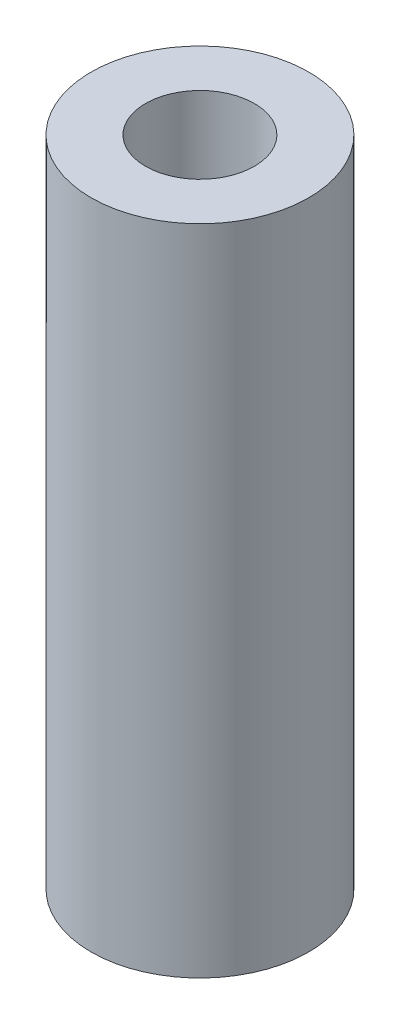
ISO-10303-21;
HEADER;
FILE_DESCRIPTION(('STEP AP214'),'2;1');
FILE_NAME('part.step','',(''),(''),'','','');
FILE_SCHEMA(('AUTOMOTIVE_DESIGN { 1 0 10303 214 1 1 1 1 }'));
ENDSEC;
DATA;
#1=APPLICATION_CONTEXT('core data for automotive mechanical design processes');
#2=APPLICATION_PROTOCOL_DEFINITION('international standard','automotive_design',2000,#1);
#3=PRODUCT_CONTEXT('',#1,'mechanical');
#4=PRODUCT('Part','Part','',(#3));
#5=PRODUCT_RELATED_PRODUCT_CATEGORY('part','',(#4));
#6=PRODUCT_DEFINITION_FORMATION('','',#4);
#7=PRODUCT_DEFINITION_CONTEXT('part definition',#1,'design');
#8=PRODUCT_DEFINITION('design','',#6,#7);
#9=PRODUCT_DEFINITION_SHAPE('','',#8);
#10=(LENGTH_UNIT() NAMED_UNIT(*) SI_UNIT(.MILLI.,.METRE.));
#11=(NAMED_UNIT(*) PLANE_ANGLE_UNIT() SI_UNIT($,.RADIAN.));
#12=(NAMED_UNIT(*) SI_UNIT($,.STERADIAN.) SOLID_ANGLE_UNIT());
#13=UNCERTAINTY_MEASURE_WITH_UNIT(LENGTH_MEASURE(1.E-05),#10,'distance_accuracy_value','');
#14=(GEOMETRIC_REPRESENTATION_CONTEXT(3) GLOBAL_UNCERTAINTY_ASSIGNED_CONTEXT((#13)) GLOBAL_UNIT_ASSIGNED_CONTEXT((#10,
#11,#12)) REPRESENTATION_CONTEXT('',''));
#15=CARTESIAN_POINT('',(0.,0.,0.));
#16=DIRECTION('',(0.,0.,1.));
#17=DIRECTION('',(1.,0.,0.));
#18=AXIS2_PLACEMENT_3D('',#15,#16,#17);
#19=CARTESIAN_POINT('',(0.,0.,0.));
#20=DIRECTION('',(0.,1.,0.));
#21=DIRECTION('',(0.,0.,1.));
#22=AXIS2_PLACEMENT_3D('',#19,#20,#21);
#23=CYLINDRICAL_SURFACE('',#22,6.35);
#24=CARTESIAN_POINT('',(0.,38.1,0.));
#25=DIRECTION('',(0.,1.,0.));
#26=DIRECTION('',(0.,0.,1.));
#27=AXIS2_PLACEMENT_3D('',#24,#25,#26);
#28=CIRCLE('',#27,6.35);
#29=CARTESIAN_POINT('',(0.,38.1,6.35));
#30=VERTEX_POINT('',#29);
#31=EDGE_CURVE('E53',#30,#30,#28,.T.);
#32=ORIENTED_EDGE('',*,*,#31,.F.);
#33=EDGE_LOOP('',(#32));
#34=FACE_BOUND('',#33,.T.);
#35=CARTESIAN_POINT('',(0.,0.,0.));
#36=DIRECTION('',(0.,1.,0.));
#37=DIRECTION('',(0.,0.,1.));
#38=AXIS2_PLACEMENT_3D('',#35,#36,#37);
#39=CIRCLE('',#38,6.35);
#40=CARTESIAN_POINT('',(0.,0.,6.35));
#41=VERTEX_POINT('',#40);
#42=EDGE_CURVE('E38',#41,#41,#39,.T.);
#43=ORIENTED_EDGE('',*,*,#42,.T.);
#44=EDGE_LOOP('',(#43));
#45=FACE_BOUND('',#44,.T.);
#46=ADVANCED_FACE('F35',(#34,#45),#23,.T.);
#47=CARTESIAN_POINT('',(0.,0.,0.));
#48=DIRECTION('',(0.,1.,0.));
#49=DIRECTION('',(0.,0.,1.));
#50=AXIS2_PLACEMENT_3D('',#47,#48,#49);
#51=PLANE('',#50);
#52=CARTESIAN_POINT('',(0.,0.,0.));
#53=DIRECTION('',(0.,1.,0.));
#54=DIRECTION('',(0.,0.,1.));
#55=AXIS2_PLACEMENT_3D('',#52,#53,#54);
#56=CIRCLE('',#55,3.175);
#57=CARTESIAN_POINT('',(0.,0.,3.175));
#58=VERTEX_POINT('',#57);
#59=EDGE_CURVE('E43',#58,#58,#56,.F.);
#60=ORIENTED_EDGE('',*,*,#59,.F.);
#61=EDGE_LOOP('',(#60));
#62=FACE_BOUND('',#61,.T.);
#63=ORIENTED_EDGE('',*,*,#42,.F.);
#64=EDGE_LOOP('',(#63));
#65=FACE_BOUND('',#64,.T.);
#66=ADVANCED_FACE('F71',(#62,#65),#51,.F.);
#67=CARTESIAN_POINT('',(0.,38.1,0.));
#68=DIRECTION('',(0.,1.,0.));
#69=DIRECTION('',(0.,0.,1.));
#70=AXIS2_PLACEMENT_3D('',#67,#68,#69);
#71=PLANE('',#70);
#72=CARTESIAN_POINT('',(0.,38.1,0.));
#73=DIRECTION('',(0.,1.,0.));
#74=DIRECTION('',(0.,0.,1.));
#75=AXIS2_PLACEMENT_3D('',#72,#73,#74);
#76=CIRCLE('',#75,3.175);
#77=CARTESIAN_POINT('',(0.,38.1,3.175));
#78=VERTEX_POINT('',#77);
#79=EDGE_CURVE('E11',#78,#78,#76,.F.);
#80=ORIENTED_EDGE('',*,*,#79,.T.);
#81=EDGE_LOOP('',(#80));
#82=FACE_BOUND('',#81,.T.);
#83=ORIENTED_EDGE('',*,*,#31,.T.);
#84=EDGE_LOOP('',(#83));
#85=FACE_BOUND('',#84,.T.);
#86=ADVANCED_FACE('F60',(#82,#85),#71,.T.);
#87=CARTESIAN_POINT('',(0.,0.,0.));
#88=DIRECTION('',(0.,1.,0.));
#89=DIRECTION('',(0.,0.,1.));
#90=AXIS2_PLACEMENT_3D('',#87,#88,#89);
#91=CYLINDRICAL_SURFACE('',#90,3.175);
#92=ORIENTED_EDGE('',*,*,#79,.F.);
#93=EDGE_LOOP('',(#92));
#94=FACE_BOUND('',#93,.T.);
#95=ORIENTED_EDGE('',*,*,#59,.T.);
#96=EDGE_LOOP('',(#95));
#97=FACE_BOUND('',#96,.T.);
#98=ADVANCED_FACE('F63',(#94,#97),#91,.F.);
#99=CLOSED_SHELL('',(#46,#66,#86,#98));
#100=MANIFOLD_SOLID_BREP('B2',#99);
#101=ADVANCED_BREP_SHAPE_REPRESENTATION('',(#18,#100),#14);
#102=SHAPE_DEFINITION_REPRESENTATION(#9,#101);
ENDSEC;
END-ISO-10303-21;
